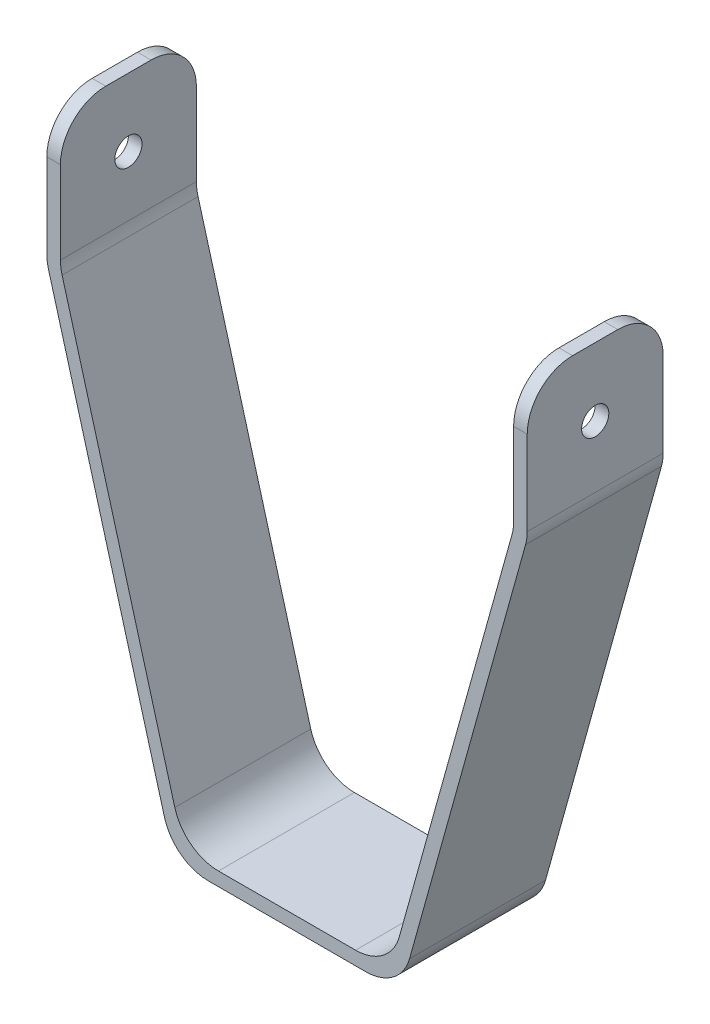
ISO-10303-21;
HEADER;
FILE_DESCRIPTION(('STEP AP214'),'2;1');
FILE_NAME('part.step','',(''),(''),'','','');
FILE_SCHEMA(('AUTOMOTIVE_DESIGN { 1 0 10303 214 1 1 1 1 }'));
ENDSEC;
DATA;
#1=APPLICATION_CONTEXT('core data for automotive mechanical design processes');
#2=APPLICATION_PROTOCOL_DEFINITION('international standard','automotive_design',2000,#1);
#3=PRODUCT_CONTEXT('',#1,'mechanical');
#4=PRODUCT('Part','Part','',(#3));
#5=PRODUCT_RELATED_PRODUCT_CATEGORY('part','',(#4));
#6=PRODUCT_DEFINITION_FORMATION('','',#4);
#7=PRODUCT_DEFINITION_CONTEXT('part definition',#1,'design');
#8=PRODUCT_DEFINITION('design','',#6,#7);
#9=PRODUCT_DEFINITION_SHAPE('','',#8);
#10=(LENGTH_UNIT() NAMED_UNIT(*) SI_UNIT(.MILLI.,.METRE.));
#11=(NAMED_UNIT(*) PLANE_ANGLE_UNIT() SI_UNIT($,.RADIAN.));
#12=(NAMED_UNIT(*) SI_UNIT($,.STERADIAN.) SOLID_ANGLE_UNIT());
#13=UNCERTAINTY_MEASURE_WITH_UNIT(LENGTH_MEASURE(1.E-05),#10,'distance_accuracy_value','');
#14=(GEOMETRIC_REPRESENTATION_CONTEXT(3) GLOBAL_UNCERTAINTY_ASSIGNED_CONTEXT((#13)) GLOBAL_UNIT_ASSIGNED_CONTEXT((#10,
#11,#12)) REPRESENTATION_CONTEXT('',''));
#15=CARTESIAN_POINT('',(0.,0.,0.));
#16=DIRECTION('',(0.,0.,1.));
#17=DIRECTION('',(1.,0.,0.));
#18=AXIS2_PLACEMENT_3D('',#15,#16,#17);
#19=CARTESIAN_POINT('',(-69.2992181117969,-1041.40994987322,20.4800248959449));
#20=DIRECTION('',(0.,-1.,0.));
#21=DIRECTION('',(0.,0.,-1.));
#22=AXIS2_PLACEMENT_3D('',#19,#20,#21);
#23=PLANE('',#22);
#24=DIRECTION('',(0.,0.,-1.));
#25=VECTOR('',#24,1.);
#26=CARTESIAN_POINT('',(-69.2992181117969,-1041.40994987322,20.4800248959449));
#27=LINE('',#26,#25);
#28=CARTESIAN_POINT('',(-69.2992181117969,-1041.40994987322,10.4800248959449));
#29=VERTEX_POINT('',#28);
#30=CARTESIAN_POINT('',(-69.2992181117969,-1041.40994987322,0.480024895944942));
#31=VERTEX_POINT('',#30);
#32=EDGE_CURVE('E233',#29,#31,#27,.T.);
#33=ORIENTED_EDGE('',*,*,#32,.T.);
#34=DIRECTION('',(-1.,0.,0.));
#35=VECTOR('',#34,1.);
#36=CARTESIAN_POINT('',(-69.2992181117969,-1041.40994987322,0.480024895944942));
#37=LINE('',#36,#35);
#38=CARTESIAN_POINT('',(-72.2992181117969,-1041.40994987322,0.480024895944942));
#39=VERTEX_POINT('',#38);
#40=EDGE_CURVE('E318',#31,#39,#37,.T.);
#41=ORIENTED_EDGE('',*,*,#40,.T.);
#42=DIRECTION('',(0.,0.,-1.));
#43=VECTOR('',#42,1.);
#44=CARTESIAN_POINT('',(-72.2992181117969,-1041.40994987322,20.4800248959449));
#45=LINE('',#44,#43);
#46=CARTESIAN_POINT('',(-72.2992181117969,-1041.40994987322,10.4800248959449));
#47=VERTEX_POINT('',#46);
#48=EDGE_CURVE('E218',#47,#39,#45,.T.);
#49=ORIENTED_EDGE('',*,*,#48,.F.);
#50=DIRECTION('',(-1.,0.,0.));
#51=VECTOR('',#50,1.);
#52=CARTESIAN_POINT('',(-69.2992181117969,-1041.40994987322,10.4800248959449));
#53=LINE('',#52,#51);
#54=EDGE_CURVE('E316',#47,#29,#53,.F.);
#55=ORIENTED_EDGE('',*,*,#54,.T.);
#56=EDGE_LOOP('',(#33,#41,#49,#55));
#57=FACE_BOUND('',#56,.T.);
#58=ADVANCED_FACE('F33',(#57),#23,.F.);
#59=CARTESIAN_POINT('',(-72.2992181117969,-1041.40994987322,20.4800248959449));
#60=DIRECTION('',(1.,0.,0.));
#61=DIRECTION('',(0.,0.,-1.));
#62=AXIS2_PLACEMENT_3D('',#59,#60,#61);
#63=PLANE('',#62);
#64=CARTESIAN_POINT('',(-72.2992181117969,-1056.40994987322,5.48002489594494));
#65=DIRECTION('',(-1.,0.,0.));
#66=DIRECTION('',(0.,0.,1.));
#67=AXIS2_PLACEMENT_3D('',#64,#65,#66);
#68=CIRCLE('',#67,3.);
#69=CARTESIAN_POINT('',(-72.2992181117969,-1056.40994987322,8.48002489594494));
#70=VERTEX_POINT('',#69);
#71=EDGE_CURVE('E664',#70,#70,#68,.T.);
#72=ORIENTED_EDGE('',*,*,#71,.F.);
#73=EDGE_LOOP('',(#72));
#74=FACE_BOUND('',#73,.T.);
#75=ORIENTED_EDGE('',*,*,#48,.T.);
#76=CARTESIAN_POINT('',(-72.2992181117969,-1051.40994987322,0.480024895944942));
#77=DIRECTION('',(1.,0.,0.));
#78=DIRECTION('',(0.,0.,-1.));
#79=AXIS2_PLACEMENT_3D('',#76,#77,#78);
#80=CIRCLE('',#79,10.);
#81=CARTESIAN_POINT('',(-72.2992181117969,-1051.40994987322,-9.51997510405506));
#82=VERTEX_POINT('',#81);
#83=EDGE_CURVE('E323',#39,#82,#80,.F.);
#84=ORIENTED_EDGE('',*,*,#83,.T.);
#85=DIRECTION('',(0.,-1.,0.));
#86=VECTOR('',#85,1.);
#87=CARTESIAN_POINT('',(-72.2992181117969,-1041.40994987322,-9.51997510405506));
#88=LINE('',#87,#86);
#89=CARTESIAN_POINT('',(-72.2992181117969,-1070.04345029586,-9.51997510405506));
#90=VERTEX_POINT('',#89);
#91=EDGE_CURVE('E354',#82,#90,#88,.T.);
#92=ORIENTED_EDGE('',*,*,#91,.T.);
#93=DIRECTION('',(0.,0.,-1.));
#94=VECTOR('',#93,1.);
#95=CARTESIAN_POINT('',(-72.2992181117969,-1070.04345029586,20.4800248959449));
#96=LINE('',#95,#94);
#97=CARTESIAN_POINT('',(-72.2992181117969,-1070.04345029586,20.4800248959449));
#98=VERTEX_POINT('',#97);
#99=EDGE_CURVE('E266',#90,#98,#96,.F.);
#100=ORIENTED_EDGE('',*,*,#99,.T.);
#101=DIRECTION('',(0.,-1.,0.));
#102=VECTOR('',#101,1.);
#103=CARTESIAN_POINT('',(-72.2992181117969,-1041.40994987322,20.4800248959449));
#104=LINE('',#103,#102);
#105=CARTESIAN_POINT('',(-72.2992181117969,-1051.40994987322,20.4800248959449));
#106=VERTEX_POINT('',#105);
#107=EDGE_CURVE('E224',#106,#98,#104,.T.);
#108=ORIENTED_EDGE('',*,*,#107,.F.);
#109=CARTESIAN_POINT('',(-72.2992181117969,-1051.40994987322,10.4800248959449));
#110=DIRECTION('',(1.,0.,0.));
#111=DIRECTION('',(0.,0.,-1.));
#112=AXIS2_PLACEMENT_3D('',#109,#110,#111);
#113=CIRCLE('',#112,10.);
#114=EDGE_CURVE('E321',#106,#47,#113,.F.);
#115=ORIENTED_EDGE('',*,*,#114,.T.);
#116=EDGE_LOOP('',(#75,#84,#92,#100,#108,#115));
#117=FACE_BOUND('',#116,.T.);
#118=ADVANCED_FACE('F350',(#74,#117),#63,.F.);
#119=CARTESIAN_POINT('',(-72.2992181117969,-1071.40994987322,20.4800248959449));
#120=DIRECTION('',(0.963338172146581,0.268290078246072,0.));
#121=DIRECTION('',(-0.268290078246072,0.963338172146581,0.));
#122=AXIS2_PLACEMENT_3D('',#119,#120,#121);
#123=PLANE('',#122);
#124=DIRECTION('',(0.268290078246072,-0.963338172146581,0.));
#125=VECTOR('',#124,1.);
#126=CARTESIAN_POINT('',(-72.2992181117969,-1071.40994987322,20.4800248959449));
#127=LINE('',#126,#125);
#128=CARTESIAN_POINT('',(-71.9325998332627,-1072.72635107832,20.4800248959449));
#129=VERTEX_POINT('',#128);
#130=CARTESIAN_POINT('',(-46.3370332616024,-1164.63130141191,20.4800248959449));
#131=VERTEX_POINT('',#130);
#132=EDGE_CURVE('E227',#129,#131,#127,.T.);
#133=ORIENTED_EDGE('',*,*,#132,.F.);
#134=DIRECTION('',(0.,0.,-1.));
#135=VECTOR('',#134,1.);
#136=CARTESIAN_POINT('',(-71.9325998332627,-1072.72635107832,20.4800248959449));
#137=LINE('',#136,#135);
#138=CARTESIAN_POINT('',(-71.9325998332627,-1072.72635107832,-9.51997510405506));
#139=VERTEX_POINT('',#138);
#140=EDGE_CURVE('E254',#129,#139,#137,.T.);
#141=ORIENTED_EDGE('',*,*,#140,.T.);
#142=DIRECTION('',(0.268290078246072,-0.963338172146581,0.));
#143=VECTOR('',#142,1.);
#144=CARTESIAN_POINT('',(-72.2992181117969,-1071.40994987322,-9.51997510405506));
#145=LINE('',#144,#143);
#146=CARTESIAN_POINT('',(-46.3370332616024,-1164.63130141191,-9.51997510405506));
#147=VERTEX_POINT('',#146);
#148=EDGE_CURVE('E390',#139,#147,#145,.T.);
#149=ORIENTED_EDGE('',*,*,#148,.T.);
#150=DIRECTION('',(0.,0.,-1.));
#151=VECTOR('',#150,1.);
#152=CARTESIAN_POINT('',(-46.3370332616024,-1164.63130141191,20.4800248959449));
#153=LINE('',#152,#151);
#154=EDGE_CURVE('E252',#147,#131,#153,.F.);
#155=ORIENTED_EDGE('',*,*,#154,.T.);
#156=EDGE_LOOP('',(#133,#141,#149,#155));
#157=FACE_BOUND('',#156,.T.);
#158=ADVANCED_FACE('F362',(#157),#123,.F.);
#159=CARTESIAN_POINT('',(-44.2992181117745,-1171.94840062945,20.4800248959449));
#160=DIRECTION('',(0.,1.,0.));
#161=DIRECTION('',(-1.,0.,0.));
#162=AXIS2_PLACEMENT_3D('',#159,#160,#161);
#163=PLANE('',#162);
#164=DIRECTION('',(1.,0.,0.));
#165=VECTOR('',#164,1.);
#166=CARTESIAN_POINT('',(-44.2992181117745,-1171.94840062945,-9.51997510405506));
#167=LINE('',#166,#165);
#168=CARTESIAN_POINT('',(-36.7036515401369,-1171.94840062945,-9.51997510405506));
#169=VERTEX_POINT('',#168);
#170=CARTESIAN_POINT('',(-1.8947846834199,-1171.94840062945,-9.51997510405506));
#171=VERTEX_POINT('',#170);
#172=EDGE_CURVE('E392',#169,#171,#167,.T.);
#173=ORIENTED_EDGE('',*,*,#172,.T.);
#174=DIRECTION('',(0.,0.,-1.));
#175=VECTOR('',#174,1.);
#176=CARTESIAN_POINT('',(-1.89478468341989,-1171.94840062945,20.4800248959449));
#177=LINE('',#176,#175);
#178=CARTESIAN_POINT('',(-1.8947846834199,-1171.94840062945,20.4800248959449));
#179=VERTEX_POINT('',#178);
#180=EDGE_CURVE('E207',#171,#179,#177,.F.);
#181=ORIENTED_EDGE('',*,*,#180,.T.);
#182=DIRECTION('',(1.,0.,0.));
#183=VECTOR('',#182,1.);
#184=CARTESIAN_POINT('',(-44.2992181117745,-1171.94840062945,20.4800248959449));
#185=LINE('',#184,#183);
#186=CARTESIAN_POINT('',(-36.7036515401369,-1171.94840062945,20.4800248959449));
#187=VERTEX_POINT('',#186);
#188=EDGE_CURVE('E366',#187,#179,#185,.T.);
#189=ORIENTED_EDGE('',*,*,#188,.F.);
#190=DIRECTION('',(0.,0.,-1.));
#191=VECTOR('',#190,1.);
#192=CARTESIAN_POINT('',(-36.7036515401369,-1171.94840062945,20.4800248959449));
#193=LINE('',#192,#191);
#194=EDGE_CURVE('E298',#187,#169,#193,.T.);
#195=ORIENTED_EDGE('',*,*,#194,.T.);
#196=EDGE_LOOP('',(#173,#181,#189,#195));
#197=FACE_BOUND('',#196,.T.);
#198=ADVANCED_FACE('F515',(#197),#163,.F.);
#199=CARTESIAN_POINT('',(33.700781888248,-1071.40994987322,20.4800248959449));
#200=DIRECTION('',(-0.963338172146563,0.268290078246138,0.));
#201=DIRECTION('',(-0.268290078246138,-0.963338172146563,0.));
#202=AXIS2_PLACEMENT_3D('',#199,#200,#201);
#203=PLANE('',#202);
#204=DIRECTION('',(0.268290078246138,0.963338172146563,0.));
#205=VECTOR('',#204,1.);
#206=CARTESIAN_POINT('',(33.700781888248,-1071.40994987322,-9.51997510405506));
#207=LINE('',#206,#205);
#208=CARTESIAN_POINT('',(7.73859703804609,-1164.63130141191,-9.51997510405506));
#209=VERTEX_POINT('',#208);
#210=CARTESIAN_POINT('',(33.3341636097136,-1072.72635107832,-9.51997510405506));
#211=VERTEX_POINT('',#210);
#212=EDGE_CURVE('E395',#209,#211,#207,.T.);
#213=ORIENTED_EDGE('',*,*,#212,.T.);
#214=DIRECTION('',(0.,0.,-1.));
#215=VECTOR('',#214,1.);
#216=CARTESIAN_POINT('',(33.3341636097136,-1072.72635107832,20.4800248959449));
#217=LINE('',#216,#215);
#218=CARTESIAN_POINT('',(33.3341636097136,-1072.72635107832,20.4800248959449));
#219=VERTEX_POINT('',#218);
#220=EDGE_CURVE('E291',#211,#219,#217,.F.);
#221=ORIENTED_EDGE('',*,*,#220,.T.);
#222=DIRECTION('',(0.268290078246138,0.963338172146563,0.));
#223=VECTOR('',#222,1.);
#224=CARTESIAN_POINT('',(33.700781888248,-1071.40994987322,20.4800248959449));
#225=LINE('',#224,#223);
#226=CARTESIAN_POINT('',(7.73859703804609,-1164.63130141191,20.4800248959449));
#227=VERTEX_POINT('',#226);
#228=EDGE_CURVE('E369',#227,#219,#225,.T.);
#229=ORIENTED_EDGE('',*,*,#228,.F.);
#230=DIRECTION('',(0.,0.,-1.));
#231=VECTOR('',#230,1.);
#232=CARTESIAN_POINT('',(7.73859703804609,-1164.63130141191,20.4800248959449));
#233=LINE('',#232,#231);
#234=EDGE_CURVE('E288',#227,#209,#233,.T.);
#235=ORIENTED_EDGE('',*,*,#234,.T.);
#236=EDGE_LOOP('',(#213,#221,#229,#235));
#237=FACE_BOUND('',#236,.T.);
#238=ADVANCED_FACE('F508',(#237),#203,.F.);
#239=CARTESIAN_POINT('',(33.700781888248,-1041.40994987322,20.4800248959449));
#240=DIRECTION('',(-1.,0.,0.));
#241=DIRECTION('',(0.,0.,1.));
#242=AXIS2_PLACEMENT_3D('',#239,#240,#241);
#243=PLANE('',#242);
#244=CARTESIAN_POINT('',(33.700781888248,-1056.40994987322,5.48002489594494));
#245=DIRECTION('',(-1.,0.,0.));
#246=DIRECTION('',(0.,0.,1.));
#247=AXIS2_PLACEMENT_3D('',#244,#245,#246);
#248=CIRCLE('',#247,3.);
#249=CARTESIAN_POINT('',(33.700781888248,-1056.40994987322,8.48002489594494));
#250=VERTEX_POINT('',#249);
#251=EDGE_CURVE('E247',#250,#250,#248,.T.);
#252=ORIENTED_EDGE('',*,*,#251,.T.);
#253=EDGE_LOOP('',(#252));
#254=FACE_BOUND('',#253,.T.);
#255=DIRECTION('',(0.,1.,0.));
#256=VECTOR('',#255,1.);
#257=CARTESIAN_POINT('',(33.700781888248,-1041.40994987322,-9.51997510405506));
#258=LINE('',#257,#256);
#259=CARTESIAN_POINT('',(33.700781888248,-1070.04345029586,-9.51997510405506));
#260=VERTEX_POINT('',#259);
#261=CARTESIAN_POINT('',(33.700781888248,-1051.40994987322,-9.51997510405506));
#262=VERTEX_POINT('',#261);
#263=EDGE_CURVE('E398',#260,#262,#258,.T.);
#264=ORIENTED_EDGE('',*,*,#263,.T.);
#265=CARTESIAN_POINT('',(33.700781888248,-1051.40994987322,0.480024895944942));
#266=DIRECTION('',(-1.,0.,0.));
#267=DIRECTION('',(0.,0.,1.));
#268=AXIS2_PLACEMENT_3D('',#265,#266,#267);
#269=CIRCLE('',#268,10.);
#270=CARTESIAN_POINT('',(33.700781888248,-1041.40994987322,0.480024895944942));
#271=VERTEX_POINT('',#270);
#272=EDGE_CURVE('E341',#262,#271,#269,.F.);
#273=ORIENTED_EDGE('',*,*,#272,.T.);
#274=DIRECTION('',(0.,0.,-1.));
#275=VECTOR('',#274,1.);
#276=CARTESIAN_POINT('',(33.700781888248,-1041.40994987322,20.4800248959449));
#277=LINE('',#276,#275);
#278=CARTESIAN_POINT('',(33.700781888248,-1041.40994987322,10.4800248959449));
#279=VERTEX_POINT('',#278);
#280=EDGE_CURVE('E239',#279,#271,#277,.T.);
#281=ORIENTED_EDGE('',*,*,#280,.F.);
#282=CARTESIAN_POINT('',(33.700781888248,-1051.40994987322,10.4800248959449));
#283=DIRECTION('',(-1.,0.,0.));
#284=DIRECTION('',(0.,0.,1.));
#285=AXIS2_PLACEMENT_3D('',#282,#283,#284);
#286=CIRCLE('',#285,10.);
#287=CARTESIAN_POINT('',(33.700781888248,-1051.40994987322,20.4800248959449));
#288=VERTEX_POINT('',#287);
#289=EDGE_CURVE('E48',#279,#288,#286,.F.);
#290=ORIENTED_EDGE('',*,*,#289,.T.);
#291=DIRECTION('',(0.,1.,0.));
#292=VECTOR('',#291,1.);
#293=CARTESIAN_POINT('',(33.700781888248,-1041.40994987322,20.4800248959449));
#294=LINE('',#293,#292);
#295=CARTESIAN_POINT('',(33.700781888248,-1070.04345029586,20.4800248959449));
#296=VERTEX_POINT('',#295);
#297=EDGE_CURVE('E375',#296,#288,#294,.T.);
#298=ORIENTED_EDGE('',*,*,#297,.F.);
#299=DIRECTION('',(0.,0.,-1.));
#300=VECTOR('',#299,1.);
#301=CARTESIAN_POINT('',(33.700781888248,-1070.04345029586,20.4800248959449));
#302=LINE('',#301,#300);
#303=EDGE_CURVE('E285',#296,#260,#302,.T.);
#304=ORIENTED_EDGE('',*,*,#303,.T.);
#305=EDGE_LOOP('',(#264,#273,#281,#290,#298,#304));
#306=FACE_BOUND('',#305,.T.);
#307=ADVANCED_FACE('F497',(#254,#306),#243,.F.);
#308=CARTESIAN_POINT('',(30.700781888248,-1041.40994987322,20.4800248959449));
#309=DIRECTION('',(0.,-1.,0.));
#310=DIRECTION('',(0.,0.,-1.));
#311=AXIS2_PLACEMENT_3D('',#308,#309,#310);
#312=PLANE('',#311);
#313=ORIENTED_EDGE('',*,*,#280,.T.);
#314=DIRECTION('',(-1.,0.,0.));
#315=VECTOR('',#314,1.);
#316=CARTESIAN_POINT('',(30.700781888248,-1041.40994987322,0.480024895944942));
#317=LINE('',#316,#315);
#318=CARTESIAN_POINT('',(30.700781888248,-1041.40994987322,0.480024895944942));
#319=VERTEX_POINT('',#318);
#320=EDGE_CURVE('E334',#271,#319,#317,.T.);
#321=ORIENTED_EDGE('',*,*,#320,.T.);
#322=DIRECTION('',(0.,0.,-1.));
#323=VECTOR('',#322,1.);
#324=CARTESIAN_POINT('',(30.700781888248,-1041.40994987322,20.4800248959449));
#325=LINE('',#324,#323);
#326=CARTESIAN_POINT('',(30.700781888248,-1041.40994987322,10.4800248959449));
#327=VERTEX_POINT('',#326);
#328=EDGE_CURVE('E236',#327,#319,#325,.T.);
#329=ORIENTED_EDGE('',*,*,#328,.F.);
#330=DIRECTION('',(-1.,0.,0.));
#331=VECTOR('',#330,1.);
#332=CARTESIAN_POINT('',(33.700781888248,-1041.40994987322,10.4800248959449));
#333=LINE('',#332,#331);
#334=EDGE_CURVE('E332',#327,#279,#333,.F.);
#335=ORIENTED_EDGE('',*,*,#334,.T.);
#336=EDGE_LOOP('',(#313,#321,#329,#335));
#337=FACE_BOUND('',#336,.T.);
#338=ADVANCED_FACE('F499',(#337),#312,.F.);
#339=CARTESIAN_POINT('',(30.700781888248,-1041.40994987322,20.4800248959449));
#340=DIRECTION('',(1.,0.,0.));
#341=DIRECTION('',(0.,0.,-1.));
#342=AXIS2_PLACEMENT_3D('',#339,#340,#341);
#343=PLANE('',#342);
#344=CARTESIAN_POINT('',(30.700781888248,-1056.40994987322,5.48002489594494));
#345=DIRECTION('',(1.,0.,0.));
#346=DIRECTION('',(0.,0.,-1.));
#347=AXIS2_PLACEMENT_3D('',#344,#345,#346);
#348=CIRCLE('',#347,3.);
#349=CARTESIAN_POINT('',(30.700781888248,-1056.40994987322,2.48002489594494));
#350=VERTEX_POINT('',#349);
#351=EDGE_CURVE('E246',#350,#350,#348,.T.);
#352=ORIENTED_EDGE('',*,*,#351,.T.);
#353=EDGE_LOOP('',(#352));
#354=FACE_BOUND('',#353,.T.);
#355=ORIENTED_EDGE('',*,*,#328,.T.);
#356=CARTESIAN_POINT('',(30.700781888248,-1051.40994987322,0.480024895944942));
#357=DIRECTION('',(1.,0.,0.));
#358=DIRECTION('',(0.,0.,-1.));
#359=AXIS2_PLACEMENT_3D('',#356,#357,#358);
#360=CIRCLE('',#359,10.);
#361=CARTESIAN_POINT('',(30.700781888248,-1051.40994987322,-9.51997510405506));
#362=VERTEX_POINT('',#361);
#363=EDGE_CURVE('E338',#319,#362,#360,.F.);
#364=ORIENTED_EDGE('',*,*,#363,.T.);
#365=DIRECTION('',(0.,-1.,0.));
#366=VECTOR('',#365,1.);
#367=CARTESIAN_POINT('',(30.700781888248,-1041.40994987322,-9.51997510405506));
#368=LINE('',#367,#366);
#369=CARTESIAN_POINT('',(30.700781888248,-1069.63350042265,-9.51997510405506));
#370=VERTEX_POINT('',#369);
#371=EDGE_CURVE('E401',#362,#370,#368,.T.);
#372=ORIENTED_EDGE('',*,*,#371,.T.);
#373=DIRECTION('',(0.,0.,-1.));
#374=VECTOR('',#373,1.);
#375=CARTESIAN_POINT('',(30.700781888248,-1069.63350042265,20.4800248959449));
#376=LINE('',#375,#374);
#377=CARTESIAN_POINT('',(30.700781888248,-1069.63350042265,20.4800248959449));
#378=VERTEX_POINT('',#377);
#379=EDGE_CURVE('E282',#370,#378,#376,.F.);
#380=ORIENTED_EDGE('',*,*,#379,.T.);
#381=DIRECTION('',(0.,-1.,0.));
#382=VECTOR('',#381,1.);
#383=CARTESIAN_POINT('',(30.700781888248,-1041.40994987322,20.4800248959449));
#384=LINE('',#383,#382);
#385=CARTESIAN_POINT('',(30.700781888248,-1051.40994987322,20.4800248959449));
#386=VERTEX_POINT('',#385);
#387=EDGE_CURVE('E377',#386,#378,#384,.T.);
#388=ORIENTED_EDGE('',*,*,#387,.F.);
#389=CARTESIAN_POINT('',(30.700781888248,-1051.40994987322,10.4800248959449));
#390=DIRECTION('',(1.,0.,0.));
#391=DIRECTION('',(0.,0.,-1.));
#392=AXIS2_PLACEMENT_3D('',#389,#390,#391);
#393=CIRCLE('',#392,10.);
#394=EDGE_CURVE('E56',#386,#327,#393,.F.);
#395=ORIENTED_EDGE('',*,*,#394,.T.);
#396=EDGE_LOOP('',(#355,#364,#372,#380,#388,#395));
#397=FACE_BOUND('',#396,.T.);
#398=ADVANCED_FACE('F482',(#354,#397),#343,.F.);
#399=CARTESIAN_POINT('',(30.700781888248,-1071.00000000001,20.4800248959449));
#400=DIRECTION('',(0.963338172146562,-0.268290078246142,0.));
#401=DIRECTION('',(0.268290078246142,0.963338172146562,0.));
#402=AXIS2_PLACEMENT_3D('',#399,#400,#401);
#403=PLANE('',#402);
#404=DIRECTION('',(-0.268290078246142,-0.963338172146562,0.));
#405=VECTOR('',#404,1.);
#406=CARTESIAN_POINT('',(30.700781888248,-1071.00000000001,20.4800248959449));
#407=LINE('',#406,#405);
#408=CARTESIAN_POINT('',(30.3341636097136,-1072.31640120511,20.4800248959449));
#409=VERTEX_POINT('',#408);
#410=CARTESIAN_POINT('',(5.45992706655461,-1161.63130141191,20.4800248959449));
#411=VERTEX_POINT('',#410);
#412=EDGE_CURVE('E379',#409,#411,#407,.T.);
#413=ORIENTED_EDGE('',*,*,#412,.F.);
#414=DIRECTION('',(0.,0.,-1.));
#415=VECTOR('',#414,1.);
#416=CARTESIAN_POINT('',(30.3341636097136,-1072.31640120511,-9.51997510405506));
#417=LINE('',#416,#415);
#418=CARTESIAN_POINT('',(30.3341636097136,-1072.31640120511,-9.51997510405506));
#419=VERTEX_POINT('',#418);
#420=EDGE_CURVE('E279',#409,#419,#417,.T.);
#421=ORIENTED_EDGE('',*,*,#420,.T.);
#422=DIRECTION('',(-0.268290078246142,-0.963338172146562,0.));
#423=VECTOR('',#422,1.);
#424=CARTESIAN_POINT('',(30.700781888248,-1071.00000000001,-9.51997510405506));
#425=LINE('',#424,#423);
#426=CARTESIAN_POINT('',(5.45992706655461,-1161.63130141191,-9.51997510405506));
#427=VERTEX_POINT('',#426);
#428=EDGE_CURVE('E403',#419,#427,#425,.T.);
#429=ORIENTED_EDGE('',*,*,#428,.T.);
#430=DIRECTION('',(0.,0.,-1.));
#431=VECTOR('',#430,1.);
#432=CARTESIAN_POINT('',(5.4599270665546,-1161.63130141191,20.4800248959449));
#433=LINE('',#432,#431);
#434=EDGE_CURVE('E277',#427,#411,#433,.F.);
#435=ORIENTED_EDGE('',*,*,#434,.T.);
#436=EDGE_LOOP('',(#413,#421,#429,#435));
#437=FACE_BOUND('',#436,.T.);
#438=ADVANCED_FACE('F428',(#437),#403,.F.);
#439=CARTESIAN_POINT('',(-42.0205481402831,-1168.94840062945,20.4800248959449));
#440=DIRECTION('',(0.,-1.,0.));
#441=DIRECTION('',(1.,0.,0.));
#442=AXIS2_PLACEMENT_3D('',#439,#440,#441);
#443=PLANE('',#442);
#444=DIRECTION('',(-1.,0.,0.));
#445=VECTOR('',#444,1.);
#446=CARTESIAN_POINT('',(-42.0205481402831,-1168.94840062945,-9.51997510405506));
#447=LINE('',#446,#445);
#448=CARTESIAN_POINT('',(-4.17345465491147,-1168.94840062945,-9.51997510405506));
#449=VERTEX_POINT('',#448);
#450=CARTESIAN_POINT('',(-34.4249815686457,-1168.94840062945,-9.51997510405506));
#451=VERTEX_POINT('',#450);
#452=EDGE_CURVE('E229',#449,#451,#447,.T.);
#453=ORIENTED_EDGE('',*,*,#452,.T.);
#454=DIRECTION('',(0.,0.,-1.));
#455=VECTOR('',#454,1.);
#456=CARTESIAN_POINT('',(-34.4249815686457,-1168.94840062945,20.4800248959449));
#457=LINE('',#456,#455);
#458=CARTESIAN_POINT('',(-34.4249815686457,-1168.94840062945,20.4800248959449));
#459=VERTEX_POINT('',#458);
#460=EDGE_CURVE('E296',#451,#459,#457,.F.);
#461=ORIENTED_EDGE('',*,*,#460,.T.);
#462=DIRECTION('',(-1.,0.,0.));
#463=VECTOR('',#462,1.);
#464=CARTESIAN_POINT('',(-42.0205481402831,-1168.94840062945,20.4800248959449));
#465=LINE('',#464,#463);
#466=CARTESIAN_POINT('',(-4.17345465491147,-1168.94840062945,20.4800248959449));
#467=VERTEX_POINT('',#466);
#468=EDGE_CURVE('E382',#467,#459,#465,.T.);
#469=ORIENTED_EDGE('',*,*,#468,.F.);
#470=DIRECTION('',(0.,0.,-1.));
#471=VECTOR('',#470,1.);
#472=CARTESIAN_POINT('',(-4.17345465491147,-1168.94840062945,-9.51997510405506));
#473=LINE('',#472,#471);
#474=EDGE_CURVE('E293',#467,#449,#473,.T.);
#475=ORIENTED_EDGE('',*,*,#474,.T.);
#476=EDGE_LOOP('',(#453,#461,#469,#475));
#477=FACE_BOUND('',#476,.T.);
#478=ADVANCED_FACE('F409',(#477),#443,.F.);
#479=CARTESIAN_POINT('',(-69.2992181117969,-1071.00000000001,20.4800248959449));
#480=DIRECTION('',(-0.963338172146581,-0.268290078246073,0.));
#481=DIRECTION('',(0.268290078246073,-0.963338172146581,0.));
#482=AXIS2_PLACEMENT_3D('',#479,#480,#481);
#483=PLANE('',#482);
#484=DIRECTION('',(-0.268290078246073,0.963338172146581,0.));
#485=VECTOR('',#484,1.);
#486=CARTESIAN_POINT('',(-69.2992181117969,-1071.00000000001,-9.51997510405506));
#487=LINE('',#486,#485);
#488=CARTESIAN_POINT('',(-44.0583632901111,-1161.63130141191,-9.51997510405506));
#489=VERTEX_POINT('',#488);
#490=CARTESIAN_POINT('',(-68.9325998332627,-1072.31640120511,-9.51997510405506));
#491=VERTEX_POINT('',#490);
#492=EDGE_CURVE('E225',#489,#491,#487,.T.);
#493=ORIENTED_EDGE('',*,*,#492,.T.);
#494=DIRECTION('',(0.,0.,-1.));
#495=VECTOR('',#494,1.);
#496=CARTESIAN_POINT('',(-68.9325998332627,-1072.31640120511,20.4800248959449));
#497=LINE('',#496,#495);
#498=CARTESIAN_POINT('',(-68.9325998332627,-1072.31640120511,20.4800248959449));
#499=VERTEX_POINT('',#498);
#500=EDGE_CURVE('E201',#491,#499,#497,.F.);
#501=ORIENTED_EDGE('',*,*,#500,.T.);
#502=DIRECTION('',(-0.268290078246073,0.963338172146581,0.));
#503=VECTOR('',#502,1.);
#504=CARTESIAN_POINT('',(-69.2992181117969,-1071.00000000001,20.4800248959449));
#505=LINE('',#504,#503);
#506=CARTESIAN_POINT('',(-44.0583632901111,-1161.63130141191,20.4800248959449));
#507=VERTEX_POINT('',#506);
#508=EDGE_CURVE('E385',#507,#499,#505,.T.);
#509=ORIENTED_EDGE('',*,*,#508,.F.);
#510=DIRECTION('',(0.,0.,-1.));
#511=VECTOR('',#510,1.);
#512=CARTESIAN_POINT('',(-44.0583632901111,-1161.63130141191,-9.51997510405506));
#513=LINE('',#512,#511);
#514=EDGE_CURVE('E217',#507,#489,#513,.T.);
#515=ORIENTED_EDGE('',*,*,#514,.T.);
#516=EDGE_LOOP('',(#493,#501,#509,#515));
#517=FACE_BOUND('',#516,.T.);
#518=ADVANCED_FACE('F418',(#517),#483,.F.);
#519=CARTESIAN_POINT('',(-69.2992181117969,-1041.40994987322,20.4800248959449));
#520=DIRECTION('',(-1.,0.,0.));
#521=DIRECTION('',(0.,0.,1.));
#522=AXIS2_PLACEMENT_3D('',#519,#520,#521);
#523=PLANE('',#522);
#524=CARTESIAN_POINT('',(-69.2992181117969,-1056.40994987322,5.48002489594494));
#525=DIRECTION('',(-1.,0.,0.));
#526=DIRECTION('',(0.,0.,1.));
#527=AXIS2_PLACEMENT_3D('',#524,#525,#526);
#528=CIRCLE('',#527,3.);
#529=CARTESIAN_POINT('',(-69.2992181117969,-1056.40994987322,8.48002489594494));
#530=VERTEX_POINT('',#529);
#531=EDGE_CURVE('E244',#530,#530,#528,.T.);
#532=ORIENTED_EDGE('',*,*,#531,.T.);
#533=EDGE_LOOP('',(#532));
#534=FACE_BOUND('',#533,.T.);
#535=DIRECTION('',(0.,1.,0.));
#536=VECTOR('',#535,1.);
#537=CARTESIAN_POINT('',(-69.2992181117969,-1041.40994987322,-9.51997510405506));
#538=LINE('',#537,#536);
#539=CARTESIAN_POINT('',(-69.2992181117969,-1069.63350042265,-9.51997510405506));
#540=VERTEX_POINT('',#539);
#541=CARTESIAN_POINT('',(-69.2992181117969,-1051.40994987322,-9.51997510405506));
#542=VERTEX_POINT('',#541);
#543=EDGE_CURVE('E213',#540,#542,#538,.T.);
#544=ORIENTED_EDGE('',*,*,#543,.T.);
#545=CARTESIAN_POINT('',(-69.2992181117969,-1051.40994987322,0.480024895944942));
#546=DIRECTION('',(-1.,0.,0.));
#547=DIRECTION('',(0.,0.,1.));
#548=AXIS2_PLACEMENT_3D('',#545,#546,#547);
#549=CIRCLE('',#548,10.);
#550=EDGE_CURVE('E330',#542,#31,#549,.F.);
#551=ORIENTED_EDGE('',*,*,#550,.T.);
#552=ORIENTED_EDGE('',*,*,#32,.F.);
#553=CARTESIAN_POINT('',(-69.2992181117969,-1051.40994987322,10.4800248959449));
#554=DIRECTION('',(-1.,0.,0.));
#555=DIRECTION('',(0.,0.,1.));
#556=AXIS2_PLACEMENT_3D('',#553,#554,#555);
#557=CIRCLE('',#556,10.);
#558=CARTESIAN_POINT('',(-69.2992181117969,-1051.40994987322,20.4800248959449));
#559=VERTEX_POINT('',#558);
#560=EDGE_CURVE('E328',#29,#559,#557,.F.);
#561=ORIENTED_EDGE('',*,*,#560,.T.);
#562=DIRECTION('',(0.,1.,0.));
#563=VECTOR('',#562,1.);
#564=CARTESIAN_POINT('',(-69.2992181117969,-1041.40994987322,20.4800248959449));
#565=LINE('',#564,#563);
#566=CARTESIAN_POINT('',(-69.2992181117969,-1069.63350042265,20.4800248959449));
#567=VERTEX_POINT('',#566);
#568=EDGE_CURVE('E216',#567,#559,#565,.T.);
#569=ORIENTED_EDGE('',*,*,#568,.F.);
#570=DIRECTION('',(0.,0.,-1.));
#571=VECTOR('',#570,1.);
#572=CARTESIAN_POINT('',(-69.2992181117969,-1069.63350042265,-9.51997510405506));
#573=LINE('',#572,#571);
#574=EDGE_CURVE('E200',#567,#540,#573,.T.);
#575=ORIENTED_EDGE('',*,*,#574,.T.);
#576=EDGE_LOOP('',(#544,#551,#552,#561,#569,#575));
#577=FACE_BOUND('',#576,.T.);
#578=ADVANCED_FACE('F212',(#534,#577),#523,.F.);
#579=CARTESIAN_POINT('',(0.,0.,20.4800248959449));
#580=DIRECTION('',(0.,0.,1.));
#581=DIRECTION('',(1.,0.,0.));
#582=AXIS2_PLACEMENT_3D('',#579,#580,#581);
#583=PLANE('',#582);
#584=ORIENTED_EDGE('',*,*,#297,.T.);
#585=DIRECTION('',(-1.,0.,0.));
#586=VECTOR('',#585,1.);
#587=CARTESIAN_POINT('',(30.700781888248,-1051.40994987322,20.4800248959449));
#588=LINE('',#587,#586);
#589=EDGE_CURVE('E11',#288,#386,#588,.T.);
#590=ORIENTED_EDGE('',*,*,#589,.T.);
#591=ORIENTED_EDGE('',*,*,#387,.T.);
#592=CARTESIAN_POINT('',(20.700781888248,-1069.63350042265,20.4800248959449));
#593=DIRECTION('',(0.,0.,1.));
#594=DIRECTION('',(1.,0.,0.));
#595=AXIS2_PLACEMENT_3D('',#592,#593,#594);
#596=CIRCLE('',#595,10.);
#597=EDGE_CURVE('E306',#378,#409,#596,.F.);
#598=ORIENTED_EDGE('',*,*,#597,.T.);
#599=ORIENTED_EDGE('',*,*,#412,.T.);
#600=CARTESIAN_POINT('',(-4.17345465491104,-1158.94840062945,20.4800248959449));
#601=DIRECTION('',(0.,0.,1.));
#602=DIRECTION('',(1.,0.,0.));
#603=AXIS2_PLACEMENT_3D('',#600,#601,#602);
#604=CIRCLE('',#603,10.);
#605=EDGE_CURVE('E314',#411,#467,#604,.F.);
#606=ORIENTED_EDGE('',*,*,#605,.T.);
#607=ORIENTED_EDGE('',*,*,#468,.T.);
#608=CARTESIAN_POINT('',(-34.4249815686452,-1158.94840062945,20.4800248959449));
#609=DIRECTION('',(0.,0.,1.));
#610=DIRECTION('',(1.,0.,0.));
#611=AXIS2_PLACEMENT_3D('',#608,#609,#610);
#612=CIRCLE('',#611,10.);
#613=EDGE_CURVE('E310',#459,#507,#612,.F.);
#614=ORIENTED_EDGE('',*,*,#613,.T.);
#615=ORIENTED_EDGE('',*,*,#508,.T.);
#616=CARTESIAN_POINT('',(-59.2992181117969,-1069.63350042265,20.4800248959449));
#617=DIRECTION('',(0.,0.,1.));
#618=DIRECTION('',(1.,0.,0.));
#619=AXIS2_PLACEMENT_3D('',#616,#617,#618);
#620=CIRCLE('',#619,10.);
#621=EDGE_CURVE('E206',#499,#567,#620,.F.);
#622=ORIENTED_EDGE('',*,*,#621,.T.);
#623=ORIENTED_EDGE('',*,*,#568,.T.);
#624=DIRECTION('',(-1.,0.,0.));
#625=VECTOR('',#624,1.);
#626=CARTESIAN_POINT('',(-72.2992181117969,-1051.40994987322,20.4800248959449));
#627=LINE('',#626,#625);
#628=EDGE_CURVE('E41',#559,#106,#627,.T.);
#629=ORIENTED_EDGE('',*,*,#628,.T.);
#630=ORIENTED_EDGE('',*,*,#107,.T.);
#631=CARTESIAN_POINT('',(-62.2992181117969,-1070.04345029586,20.4800248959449));
#632=DIRECTION('',(0.,0.,1.));
#633=DIRECTION('',(1.,0.,0.));
#634=AXIS2_PLACEMENT_3D('',#631,#632,#633);
#635=CIRCLE('',#634,10.);
#636=EDGE_CURVE('E275',#98,#129,#635,.T.);
#637=ORIENTED_EDGE('',*,*,#636,.T.);
#638=ORIENTED_EDGE('',*,*,#132,.T.);
#639=CARTESIAN_POINT('',(-36.7036515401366,-1161.94840062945,20.4800248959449));
#640=DIRECTION('',(0.,0.,1.));
#641=DIRECTION('',(1.,0.,0.));
#642=AXIS2_PLACEMENT_3D('',#639,#640,#641);
#643=CIRCLE('',#642,10.);
#644=EDGE_CURVE('E269',#131,#187,#643,.T.);
#645=ORIENTED_EDGE('',*,*,#644,.T.);
#646=ORIENTED_EDGE('',*,*,#188,.T.);
#647=CARTESIAN_POINT('',(-1.89478468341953,-1161.94840062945,20.4800248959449));
#648=DIRECTION('',(0.,0.,1.));
#649=DIRECTION('',(1.,0.,0.));
#650=AXIS2_PLACEMENT_3D('',#647,#648,#649);
#651=CIRCLE('',#650,10.);
#652=EDGE_CURVE('E271',#179,#227,#651,.T.);
#653=ORIENTED_EDGE('',*,*,#652,.T.);
#654=ORIENTED_EDGE('',*,*,#228,.T.);
#655=CARTESIAN_POINT('',(23.700781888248,-1070.04345029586,20.4800248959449));
#656=DIRECTION('',(0.,0.,1.));
#657=DIRECTION('',(1.,0.,0.));
#658=AXIS2_PLACEMENT_3D('',#655,#656,#657);
#659=CIRCLE('',#658,10.);
#660=EDGE_CURVE('E273',#219,#296,#659,.T.);
#661=ORIENTED_EDGE('',*,*,#660,.T.);
#662=EDGE_LOOP('',(#584,#590,#591,#598,#599,#606,#607,#614,#615,#622,#623,#629,#630,#637,#638,
#645,#646,#653,#654,#661));
#663=FACE_BOUND('',#662,.T.);
#664=ADVANCED_FACE('F346',(#663),#583,.T.);
#665=CARTESIAN_POINT('',(0.,0.,-9.51997510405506));
#666=DIRECTION('',(0.,0.,1.));
#667=DIRECTION('',(1.,0.,0.));
#668=AXIS2_PLACEMENT_3D('',#665,#666,#667);
#669=PLANE('',#668);
#670=ORIENTED_EDGE('',*,*,#91,.F.);
#671=DIRECTION('',(-1.,0.,0.));
#672=VECTOR('',#671,1.);
#673=CARTESIAN_POINT('',(0.,-1051.40994987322,-9.51997510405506));
#674=LINE('',#673,#672);
#675=EDGE_CURVE('E223',#82,#542,#674,.F.);
#676=ORIENTED_EDGE('',*,*,#675,.T.);
#677=ORIENTED_EDGE('',*,*,#543,.F.);
#678=CARTESIAN_POINT('',(-59.2992181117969,-1069.63350042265,-9.51997510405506));
#679=DIRECTION('',(0.,0.,1.));
#680=DIRECTION('',(1.,0.,0.));
#681=AXIS2_PLACEMENT_3D('',#678,#679,#680);
#682=CIRCLE('',#681,10.);
#683=EDGE_CURVE('E196',#540,#491,#682,.T.);
#684=ORIENTED_EDGE('',*,*,#683,.T.);
#685=ORIENTED_EDGE('',*,*,#492,.F.);
#686=CARTESIAN_POINT('',(-34.4249815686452,-1158.94840062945,-9.51997510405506));
#687=DIRECTION('',(0.,0.,1.));
#688=DIRECTION('',(1.,0.,0.));
#689=AXIS2_PLACEMENT_3D('',#686,#687,#688);
#690=CIRCLE('',#689,10.);
#691=EDGE_CURVE('E308',#489,#451,#690,.T.);
#692=ORIENTED_EDGE('',*,*,#691,.T.);
#693=ORIENTED_EDGE('',*,*,#452,.F.);
#694=CARTESIAN_POINT('',(-4.17345465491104,-1158.94840062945,-9.51997510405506));
#695=DIRECTION('',(0.,0.,1.));
#696=DIRECTION('',(1.,0.,0.));
#697=AXIS2_PLACEMENT_3D('',#694,#695,#696);
#698=CIRCLE('',#697,10.);
#699=EDGE_CURVE('E312',#449,#427,#698,.T.);
#700=ORIENTED_EDGE('',*,*,#699,.T.);
#701=ORIENTED_EDGE('',*,*,#428,.F.);
#702=CARTESIAN_POINT('',(20.700781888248,-1069.63350042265,-9.51997510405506));
#703=DIRECTION('',(0.,0.,1.));
#704=DIRECTION('',(1.,0.,0.));
#705=AXIS2_PLACEMENT_3D('',#702,#703,#704);
#706=CIRCLE('',#705,10.);
#707=EDGE_CURVE('E303',#419,#370,#706,.T.);
#708=ORIENTED_EDGE('',*,*,#707,.T.);
#709=ORIENTED_EDGE('',*,*,#371,.F.);
#710=DIRECTION('',(-1.,0.,0.));
#711=VECTOR('',#710,1.);
#712=CARTESIAN_POINT('',(0.,-1051.40994987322,-9.51997510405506));
#713=LINE('',#712,#711);
#714=EDGE_CURVE('E325',#362,#262,#713,.F.);
#715=ORIENTED_EDGE('',*,*,#714,.T.);
#716=ORIENTED_EDGE('',*,*,#263,.F.);
#717=CARTESIAN_POINT('',(23.700781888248,-1070.04345029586,-9.51997510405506));
#718=DIRECTION('',(0.,0.,1.));
#719=DIRECTION('',(1.,0.,0.));
#720=AXIS2_PLACEMENT_3D('',#717,#718,#719);
#721=CIRCLE('',#720,10.);
#722=EDGE_CURVE('E261',#260,#211,#721,.F.);
#723=ORIENTED_EDGE('',*,*,#722,.T.);
#724=ORIENTED_EDGE('',*,*,#212,.F.);
#725=CARTESIAN_POINT('',(-1.89478468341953,-1161.94840062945,-9.51997510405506));
#726=DIRECTION('',(0.,0.,1.));
#727=DIRECTION('',(1.,0.,0.));
#728=AXIS2_PLACEMENT_3D('',#725,#726,#727);
#729=CIRCLE('',#728,10.);
#730=EDGE_CURVE('E259',#209,#171,#729,.F.);
#731=ORIENTED_EDGE('',*,*,#730,.T.);
#732=ORIENTED_EDGE('',*,*,#172,.F.);
#733=CARTESIAN_POINT('',(-36.7036515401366,-1161.94840062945,-9.51997510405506));
#734=DIRECTION('',(0.,0.,1.));
#735=DIRECTION('',(1.,0.,0.));
#736=AXIS2_PLACEMENT_3D('',#733,#734,#735);
#737=CIRCLE('',#736,10.);
#738=EDGE_CURVE('E257',#169,#147,#737,.F.);
#739=ORIENTED_EDGE('',*,*,#738,.T.);
#740=ORIENTED_EDGE('',*,*,#148,.F.);
#741=CARTESIAN_POINT('',(-62.2992181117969,-1070.04345029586,-9.51997510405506));
#742=DIRECTION('',(0.,0.,1.));
#743=DIRECTION('',(1.,0.,0.));
#744=AXIS2_PLACEMENT_3D('',#741,#742,#743);
#745=CIRCLE('',#744,10.);
#746=EDGE_CURVE('E263',#139,#90,#745,.F.);
#747=ORIENTED_EDGE('',*,*,#746,.T.);
#748=EDGE_LOOP('',(#670,#676,#677,#684,#685,#692,#693,#700,#701,#708,#709,#715,#716,#723,#724,
#731,#732,#739,#740,#747));
#749=FACE_BOUND('',#748,.T.);
#750=ADVANCED_FACE('F221',(#749),#669,.F.);
#751=CARTESIAN_POINT('',(33.700781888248,-1056.40994987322,5.48002489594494));
#752=DIRECTION('',(-1.,0.,0.));
#753=DIRECTION('',(0.,0.,1.));
#754=AXIS2_PLACEMENT_3D('',#751,#752,#753);
#755=CYLINDRICAL_SURFACE('',#754,3.);
#756=ORIENTED_EDGE('',*,*,#71,.T.);
#757=EDGE_LOOP('',(#756));
#758=FACE_BOUND('',#757,.T.);
#759=ORIENTED_EDGE('',*,*,#531,.F.);
#760=EDGE_LOOP('',(#759));
#761=FACE_BOUND('',#760,.T.);
#762=ADVANCED_FACE('F574',(#758,#761),#755,.F.);
#763=ORIENTED_EDGE('',*,*,#251,.F.);
#764=EDGE_LOOP('',(#763));
#765=FACE_BOUND('',#764,.T.);
#766=ORIENTED_EDGE('',*,*,#351,.F.);
#767=EDGE_LOOP('',(#766));
#768=FACE_BOUND('',#767,.T.);
#769=ADVANCED_FACE('F443',(#765,#768),#755,.F.);
#770=CARTESIAN_POINT('',(-59.2992181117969,-1069.63350042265,20.4800248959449));
#771=DIRECTION('',(0.,0.,1.));
#772=DIRECTION('',(1.,0.,0.));
#773=AXIS2_PLACEMENT_3D('',#770,#771,#772);
#774=CYLINDRICAL_SURFACE('',#773,10.);
#775=ORIENTED_EDGE('',*,*,#621,.F.);
#776=ORIENTED_EDGE('',*,*,#500,.F.);
#777=ORIENTED_EDGE('',*,*,#683,.F.);
#778=ORIENTED_EDGE('',*,*,#574,.F.);
#779=EDGE_LOOP('',(#775,#776,#777,#778));
#780=FACE_BOUND('',#779,.T.);
#781=ADVANCED_FACE('F199',(#780),#774,.F.);
#782=CARTESIAN_POINT('',(-62.2992181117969,-1070.04345029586,20.4800248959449));
#783=DIRECTION('',(0.,0.,-1.));
#784=DIRECTION('',(-1.,0.,0.));
#785=AXIS2_PLACEMENT_3D('',#782,#783,#784);
#786=CYLINDRICAL_SURFACE('',#785,10.);
#787=ORIENTED_EDGE('',*,*,#636,.F.);
#788=ORIENTED_EDGE('',*,*,#99,.F.);
#789=ORIENTED_EDGE('',*,*,#746,.F.);
#790=ORIENTED_EDGE('',*,*,#140,.F.);
#791=EDGE_LOOP('',(#787,#788,#789,#790));
#792=FACE_BOUND('',#791,.T.);
#793=ADVANCED_FACE('F357',(#792),#786,.T.);
#794=CARTESIAN_POINT('',(20.700781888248,-1069.63350042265,20.4800248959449));
#795=DIRECTION('',(0.,0.,1.));
#796=DIRECTION('',(1.,0.,0.));
#797=AXIS2_PLACEMENT_3D('',#794,#795,#796);
#798=CYLINDRICAL_SURFACE('',#797,10.);
#799=ORIENTED_EDGE('',*,*,#597,.F.);
#800=ORIENTED_EDGE('',*,*,#379,.F.);
#801=ORIENTED_EDGE('',*,*,#707,.F.);
#802=ORIENTED_EDGE('',*,*,#420,.F.);
#803=EDGE_LOOP('',(#799,#800,#801,#802));
#804=FACE_BOUND('',#803,.T.);
#805=ADVANCED_FACE('F446',(#804),#798,.F.);
#806=CARTESIAN_POINT('',(23.700781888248,-1070.04345029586,20.4800248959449));
#807=DIRECTION('',(0.,0.,-1.));
#808=DIRECTION('',(-1.,0.,0.));
#809=AXIS2_PLACEMENT_3D('',#806,#807,#808);
#810=CYLINDRICAL_SURFACE('',#809,10.);
#811=ORIENTED_EDGE('',*,*,#660,.F.);
#812=ORIENTED_EDGE('',*,*,#220,.F.);
#813=ORIENTED_EDGE('',*,*,#722,.F.);
#814=ORIENTED_EDGE('',*,*,#303,.F.);
#815=EDGE_LOOP('',(#811,#812,#813,#814));
#816=FACE_BOUND('',#815,.T.);
#817=ADVANCED_FACE('F449',(#816),#810,.T.);
#818=CARTESIAN_POINT('',(-34.4249815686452,-1158.94840062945,20.4800248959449));
#819=DIRECTION('',(0.,0.,1.));
#820=DIRECTION('',(1.,0.,0.));
#821=AXIS2_PLACEMENT_3D('',#818,#819,#820);
#822=CYLINDRICAL_SURFACE('',#821,10.);
#823=ORIENTED_EDGE('',*,*,#613,.F.);
#824=ORIENTED_EDGE('',*,*,#460,.F.);
#825=ORIENTED_EDGE('',*,*,#691,.F.);
#826=ORIENTED_EDGE('',*,*,#514,.F.);
#827=EDGE_LOOP('',(#823,#824,#825,#826));
#828=FACE_BOUND('',#827,.T.);
#829=ADVANCED_FACE('F414',(#828),#822,.F.);
#830=CARTESIAN_POINT('',(-4.17345465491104,-1158.94840062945,20.4800248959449));
#831=DIRECTION('',(0.,0.,1.));
#832=DIRECTION('',(1.,0.,0.));
#833=AXIS2_PLACEMENT_3D('',#830,#831,#832);
#834=CYLINDRICAL_SURFACE('',#833,10.);
#835=ORIENTED_EDGE('',*,*,#605,.F.);
#836=ORIENTED_EDGE('',*,*,#434,.F.);
#837=ORIENTED_EDGE('',*,*,#699,.F.);
#838=ORIENTED_EDGE('',*,*,#474,.F.);
#839=EDGE_LOOP('',(#835,#836,#837,#838));
#840=FACE_BOUND('',#839,.T.);
#841=ADVANCED_FACE('F456',(#840),#834,.F.);
#842=CARTESIAN_POINT('',(-1.89478468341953,-1161.94840062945,20.4800248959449));
#843=DIRECTION('',(0.,0.,-1.));
#844=DIRECTION('',(-1.,0.,0.));
#845=AXIS2_PLACEMENT_3D('',#842,#843,#844);
#846=CYLINDRICAL_SURFACE('',#845,10.);
#847=ORIENTED_EDGE('',*,*,#652,.F.);
#848=ORIENTED_EDGE('',*,*,#180,.F.);
#849=ORIENTED_EDGE('',*,*,#730,.F.);
#850=ORIENTED_EDGE('',*,*,#234,.F.);
#851=EDGE_LOOP('',(#847,#848,#849,#850));
#852=FACE_BOUND('',#851,.T.);
#853=ADVANCED_FACE('F459',(#852),#846,.T.);
#854=CARTESIAN_POINT('',(-36.7036515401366,-1161.94840062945,20.4800248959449));
#855=DIRECTION('',(0.,0.,-1.));
#856=DIRECTION('',(-1.,0.,0.));
#857=AXIS2_PLACEMENT_3D('',#854,#855,#856);
#858=CYLINDRICAL_SURFACE('',#857,10.);
#859=ORIENTED_EDGE('',*,*,#644,.F.);
#860=ORIENTED_EDGE('',*,*,#154,.F.);
#861=ORIENTED_EDGE('',*,*,#738,.F.);
#862=ORIENTED_EDGE('',*,*,#194,.F.);
#863=EDGE_LOOP('',(#859,#860,#861,#862));
#864=FACE_BOUND('',#863,.T.);
#865=ADVANCED_FACE('F463',(#864),#858,.T.);
#866=CARTESIAN_POINT('',(-69.2992181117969,-1051.40994987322,0.480024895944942));
#867=DIRECTION('',(-1.,0.,0.));
#868=DIRECTION('',(0.,0.,1.));
#869=AXIS2_PLACEMENT_3D('',#866,#867,#868);
#870=CYLINDRICAL_SURFACE('',#869,10.);
#871=ORIENTED_EDGE('',*,*,#550,.F.);
#872=ORIENTED_EDGE('',*,*,#675,.F.);
#873=ORIENTED_EDGE('',*,*,#83,.F.);
#874=ORIENTED_EDGE('',*,*,#40,.F.);
#875=EDGE_LOOP('',(#871,#872,#873,#874));
#876=FACE_BOUND('',#875,.T.);
#877=ADVANCED_FACE('F467',(#876),#870,.T.);
#878=CARTESIAN_POINT('',(30.700781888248,-1051.40994987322,0.480024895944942));
#879=DIRECTION('',(-1.,0.,0.));
#880=DIRECTION('',(0.,0.,1.));
#881=AXIS2_PLACEMENT_3D('',#878,#879,#880);
#882=CYLINDRICAL_SURFACE('',#881,10.);
#883=ORIENTED_EDGE('',*,*,#272,.F.);
#884=ORIENTED_EDGE('',*,*,#714,.F.);
#885=ORIENTED_EDGE('',*,*,#363,.F.);
#886=ORIENTED_EDGE('',*,*,#320,.F.);
#887=EDGE_LOOP('',(#883,#884,#885,#886));
#888=FACE_BOUND('',#887,.T.);
#889=ADVANCED_FACE('F471',(#888),#882,.T.);
#890=CARTESIAN_POINT('',(0.,-1051.40994987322,10.4800248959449));
#891=DIRECTION('',(1.,0.,0.));
#892=DIRECTION('',(0.,0.,-1.));
#893=AXIS2_PLACEMENT_3D('',#890,#891,#892);
#894=CYLINDRICAL_SURFACE('',#893,10.);
#895=ORIENTED_EDGE('',*,*,#289,.F.);
#896=ORIENTED_EDGE('',*,*,#334,.F.);
#897=ORIENTED_EDGE('',*,*,#394,.F.);
#898=ORIENTED_EDGE('',*,*,#589,.F.);
#899=EDGE_LOOP('',(#895,#896,#897,#898));
#900=FACE_BOUND('',#899,.T.);
#901=ADVANCED_FACE('F474',(#900),#894,.T.);
#902=CARTESIAN_POINT('',(0.,-1051.40994987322,10.4800248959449));
#903=DIRECTION('',(1.,0.,0.));
#904=DIRECTION('',(0.,0.,-1.));
#905=AXIS2_PLACEMENT_3D('',#902,#903,#904);
#906=CYLINDRICAL_SURFACE('',#905,10.);
#907=ORIENTED_EDGE('',*,*,#560,.F.);
#908=ORIENTED_EDGE('',*,*,#54,.F.);
#909=ORIENTED_EDGE('',*,*,#114,.F.);
#910=ORIENTED_EDGE('',*,*,#628,.F.);
#911=EDGE_LOOP('',(#907,#908,#909,#910));
#912=FACE_BOUND('',#911,.T.);
#913=ADVANCED_FACE('F35',(#912),#906,.T.);
#914=CLOSED_SHELL('',(#58,#118,#158,#198,#238,#307,#338,#398,#438,#478,#518,#578,#664,#750,#762,
#769,#781,#793,#805,#817,#829,#841,#853,#865,#877,#889,#901,#913));
#915=MANIFOLD_SOLID_BREP('B2',#914);
#916=ADVANCED_BREP_SHAPE_REPRESENTATION('',(#18,#915),#14);
#917=SHAPE_DEFINITION_REPRESENTATION(#9,#916);
ENDSEC;
END-ISO-10303-21;
